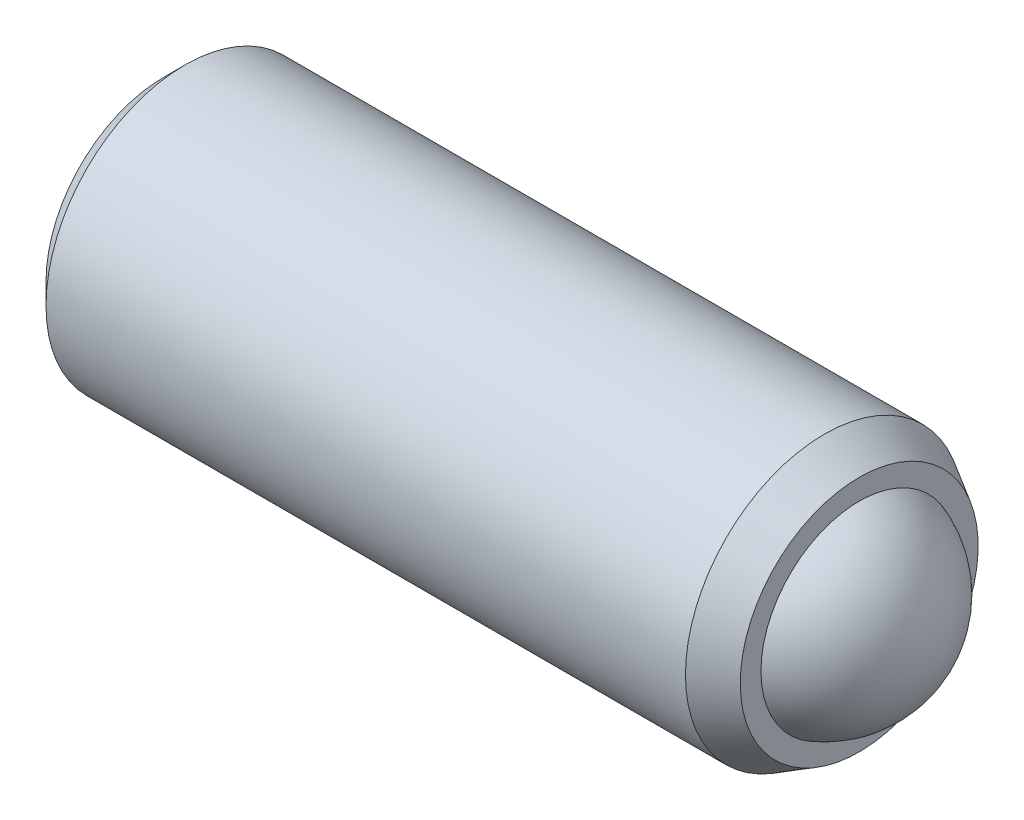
ISO-10303-21;
HEADER;
FILE_DESCRIPTION(('STEP AP214'),'2;1');
FILE_NAME('part.step','',(''),(''),'','','');
FILE_SCHEMA(('AUTOMOTIVE_DESIGN { 1 0 10303 214 1 1 1 1 }'));
ENDSEC;
DATA;
#1=APPLICATION_CONTEXT('core data for automotive mechanical design processes');
#2=APPLICATION_PROTOCOL_DEFINITION('international standard','automotive_design',2000,#1);
#3=PRODUCT_CONTEXT('',#1,'mechanical');
#4=PRODUCT('Part','Part','',(#3));
#5=PRODUCT_RELATED_PRODUCT_CATEGORY('part','',(#4));
#6=PRODUCT_DEFINITION_FORMATION('','',#4);
#7=PRODUCT_DEFINITION_CONTEXT('part definition',#1,'design');
#8=PRODUCT_DEFINITION('design','',#6,#7);
#9=PRODUCT_DEFINITION_SHAPE('','',#8);
#10=(LENGTH_UNIT() NAMED_UNIT(*) SI_UNIT(.MILLI.,.METRE.));
#11=(NAMED_UNIT(*) PLANE_ANGLE_UNIT() SI_UNIT($,.RADIAN.));
#12=(NAMED_UNIT(*) SI_UNIT($,.STERADIAN.) SOLID_ANGLE_UNIT());
#13=UNCERTAINTY_MEASURE_WITH_UNIT(LENGTH_MEASURE(1.E-05),#10,'distance_accuracy_value','');
#14=(GEOMETRIC_REPRESENTATION_CONTEXT(3) GLOBAL_UNCERTAINTY_ASSIGNED_CONTEXT((#13)) GLOBAL_UNIT_ASSIGNED_CONTEXT((#10,
#11,#12)) REPRESENTATION_CONTEXT('',''));
#15=CARTESIAN_POINT('',(0.,0.,0.));
#16=DIRECTION('',(0.,0.,1.));
#17=DIRECTION('',(1.,0.,0.));
#18=AXIS2_PLACEMENT_3D('',#15,#16,#17);
#19=CARTESIAN_POINT('',(14.25,0.,0.));
#20=DIRECTION('',(0.,-1.,0.));
#21=DIRECTION('',(-1.,0.,0.));
#22=AXIS2_PLACEMENT_3D('',#19,#20,#21);
#23=SPHERICAL_SURFACE('',#22,2.25);
#24=CARTESIAN_POINT('',(14.25,-2.25,0.));
#25=VERTEX_POINT('',#24);
#26=VERTEX_LOOP('',#25);
#27=FACE_BOUND('',#26,.T.);
#28=ADVANCED_FACE('P0_F11',(#27),#23,.T.);
#29=CLOSED_SHELL('',(#28));
#30=MANIFOLD_SOLID_BREP('P0_B1',#29);
#31=CARTESIAN_POINT('',(0.,0.,0.));
#32=DIRECTION('',(1.,0.,0.));
#33=DIRECTION('',(0.,0.,-1.));
#34=AXIS2_PLACEMENT_3D('',#31,#32,#33);
#35=PLANE('',#34);
#36=CARTESIAN_POINT('',(0.,0.,0.));
#37=DIRECTION('',(-1.,0.,0.));
#38=DIRECTION('',(0.,0.,1.));
#39=AXIS2_PLACEMENT_3D('',#36,#37,#38);
#40=CIRCLE('',#39,2.55);
#41=CARTESIAN_POINT('',(0.,0.,2.55));
#42=VERTEX_POINT('',#41);
#43=EDGE_CURVE('P1_E10',#42,#42,#40,.T.);
#44=ORIENTED_EDGE('',*,*,#43,.T.);
#45=EDGE_LOOP('',(#44));
#46=FACE_BOUND('',#45,.T.);
#47=ADVANCED_FACE('P1_F15',(#46),#35,.F.);
#48=CARTESIAN_POINT('',(0.45,0.,0.));
#49=DIRECTION('',(1.,0.,0.));
#50=DIRECTION('',(0.,0.,-1.));
#51=AXIS2_PLACEMENT_3D('',#48,#49,#50);
#52=CONICAL_SURFACE('',#51,3.,0.78539816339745);
#53=ORIENTED_EDGE('',*,*,#43,.F.);
#54=EDGE_LOOP('',(#53));
#55=FACE_BOUND('',#54,.T.);
#56=CARTESIAN_POINT('',(0.45,0.,0.));
#57=DIRECTION('',(-1.,0.,0.));
#58=DIRECTION('',(0.,0.,1.));
#59=AXIS2_PLACEMENT_3D('',#56,#57,#58);
#60=CIRCLE('',#59,3.);
#61=CARTESIAN_POINT('',(0.45,0.,3.));
#62=VERTEX_POINT('',#61);
#63=EDGE_CURVE('P1_E21',#62,#62,#60,.T.);
#64=ORIENTED_EDGE('',*,*,#63,.T.);
#65=EDGE_LOOP('',(#64));
#66=FACE_BOUND('',#65,.T.);
#67=ADVANCED_FACE('P1_F39',(#55,#66),#52,.T.);
#68=CARTESIAN_POINT('',(0.,0.,0.));
#69=DIRECTION('',(-1.,0.,0.));
#70=DIRECTION('',(0.,0.,1.));
#71=AXIS2_PLACEMENT_3D('',#68,#69,#70);
#72=CYLINDRICAL_SURFACE('',#71,3.);
#73=ORIENTED_EDGE('',*,*,#63,.F.);
#74=EDGE_LOOP('',(#73));
#75=FACE_BOUND('',#74,.T.);
#76=CARTESIAN_POINT('',(14.25,0.,0.));
#77=DIRECTION('',(-1.,0.,0.));
#78=DIRECTION('',(0.,0.,1.));
#79=AXIS2_PLACEMENT_3D('',#76,#77,#78);
#80=CIRCLE('',#79,3.);
#81=CARTESIAN_POINT('',(14.25,0.,3.));
#82=VERTEX_POINT('',#81);
#83=EDGE_CURVE('P1_E52',#82,#82,#80,.T.);
#84=ORIENTED_EDGE('',*,*,#83,.T.);
#85=EDGE_LOOP('',(#84));
#86=FACE_BOUND('',#85,.T.);
#87=ADVANCED_FACE('P1_F45',(#75,#86),#72,.T.);
#88=CARTESIAN_POINT('',(15.,0.,0.));
#89=DIRECTION('',(-1.,0.,0.));
#90=DIRECTION('',(0.,0.,1.));
#91=AXIS2_PLACEMENT_3D('',#88,#89,#90);
#92=CONICAL_SURFACE('',#91,2.56698729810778,0.5235987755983);
#93=ORIENTED_EDGE('',*,*,#83,.F.);
#94=EDGE_LOOP('',(#93));
#95=FACE_BOUND('',#94,.T.);
#96=CARTESIAN_POINT('',(15.,0.,0.));
#97=DIRECTION('',(-1.,0.,0.));
#98=DIRECTION('',(0.,0.,1.));
#99=AXIS2_PLACEMENT_3D('',#96,#97,#98);
#100=CIRCLE('',#99,2.56698729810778);
#101=CARTESIAN_POINT('',(15.,0.,2.56698729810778));
#102=VERTEX_POINT('',#101);
#103=EDGE_CURVE('P1_E54',#102,#102,#100,.T.);
#104=ORIENTED_EDGE('',*,*,#103,.T.);
#105=EDGE_LOOP('',(#104));
#106=FACE_BOUND('',#105,.T.);
#107=ADVANCED_FACE('P1_F78',(#95,#106),#92,.T.);
#108=CARTESIAN_POINT('',(15.,2.56698729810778,0.));
#109=DIRECTION('',(-1.,0.,0.));
#110=DIRECTION('',(0.,0.,1.));
#111=AXIS2_PLACEMENT_3D('',#108,#109,#110);
#112=PLANE('',#111);
#113=ORIENTED_EDGE('',*,*,#103,.F.);
#114=EDGE_LOOP('',(#113));
#115=FACE_BOUND('',#114,.T.);
#116=CARTESIAN_POINT('',(15.,0.,0.));
#117=DIRECTION('',(-1.,0.,0.));
#118=DIRECTION('',(0.,0.,1.));
#119=AXIS2_PLACEMENT_3D('',#116,#117,#118);
#120=CIRCLE('',#119,2.12132034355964);
#121=CARTESIAN_POINT('',(15.,0.,2.12132034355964));
#122=VERTEX_POINT('',#121);
#123=EDGE_CURVE('P1_E59',#122,#122,#120,.T.);
#124=ORIENTED_EDGE('',*,*,#123,.T.);
#125=EDGE_LOOP('',(#124));
#126=FACE_BOUND('',#125,.T.);
#127=ADVANCED_FACE('P1_F71',(#115,#126),#112,.F.);
#128=CARTESIAN_POINT('',(14.25,0.,0.));
#129=DIRECTION('',(-1.,0.,0.));
#130=DIRECTION('',(0.,1.,0.));
#131=AXIS2_PLACEMENT_3D('',#128,#129,#130);
#132=SPHERICAL_SURFACE('',#131,2.25);
#133=ORIENTED_EDGE('',*,*,#123,.F.);
#134=EDGE_LOOP('',(#133));
#135=FACE_BOUND('',#134,.T.);
#136=CARTESIAN_POINT('',(14.25,0.,0.));
#137=DIRECTION('',(-1.,0.,0.));
#138=DIRECTION('',(0.,0.,1.));
#139=AXIS2_PLACEMENT_3D('',#136,#137,#138);
#140=CIRCLE('',#139,2.25);
#141=CARTESIAN_POINT('',(14.25,0.,2.25));
#142=VERTEX_POINT('',#141);
#143=EDGE_CURVE('P1_E62',#142,#142,#140,.T.);
#144=ORIENTED_EDGE('',*,*,#143,.T.);
#145=EDGE_LOOP('',(#144));
#146=FACE_BOUND('',#145,.T.);
#147=ADVANCED_FACE('P1_F34',(#135,#146),#132,.F.);
#148=CARTESIAN_POINT('',(0.,0.,0.));
#149=DIRECTION('',(-1.,0.,0.));
#150=DIRECTION('',(0.,0.,1.));
#151=AXIS2_PLACEMENT_3D('',#148,#149,#150);
#152=CYLINDRICAL_SURFACE('',#151,2.25);
#153=ORIENTED_EDGE('',*,*,#143,.F.);
#154=EDGE_LOOP('',(#153));
#155=FACE_BOUND('',#154,.T.);
#156=CARTESIAN_POINT('',(3.17403810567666,0.,0.));
#157=DIRECTION('',(-1.,0.,0.));
#158=DIRECTION('',(0.,0.,1.));
#159=AXIS2_PLACEMENT_3D('',#156,#157,#158);
#160=CIRCLE('',#159,2.25);
#161=CARTESIAN_POINT('',(3.17403810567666,0.,2.25));
#162=VERTEX_POINT('',#161);
#163=EDGE_CURVE('P1_E65',#162,#162,#160,.T.);
#164=ORIENTED_EDGE('',*,*,#163,.T.);
#165=EDGE_LOOP('',(#164));
#166=FACE_BOUND('',#165,.T.);
#167=ADVANCED_FACE('P1_F26',(#155,#166),#152,.F.);
#168=CARTESIAN_POINT('',(1.875,0.,0.));
#169=DIRECTION('',(1.,0.,0.));
#170=DIRECTION('',(0.,0.,-1.));
#171=AXIS2_PLACEMENT_3D('',#168,#169,#170);
#172=CONICAL_SURFACE('',#171,0.,1.0471975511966);
#173=ORIENTED_EDGE('',*,*,#163,.F.);
#174=EDGE_LOOP('',(#173));
#175=FACE_BOUND('',#174,.T.);
#176=CARTESIAN_POINT('',(1.875,0.,0.));
#177=VERTEX_POINT('',#176);
#178=VERTEX_LOOP('',#177);
#179=FACE_BOUND('',#178,.T.);
#180=ADVANCED_FACE('P1_F24',(#175,#179),#172,.F.);
#181=CLOSED_SHELL('',(#47,#67,#87,#107,#127,#147,#167,#180));
#182=MANIFOLD_SOLID_BREP('P1_B1',#181);
#183=ADVANCED_BREP_SHAPE_REPRESENTATION('',(#18,#30,#182),#14);
#184=SHAPE_DEFINITION_REPRESENTATION(#9,#183);
ENDSEC;
END-ISO-10303-21;
